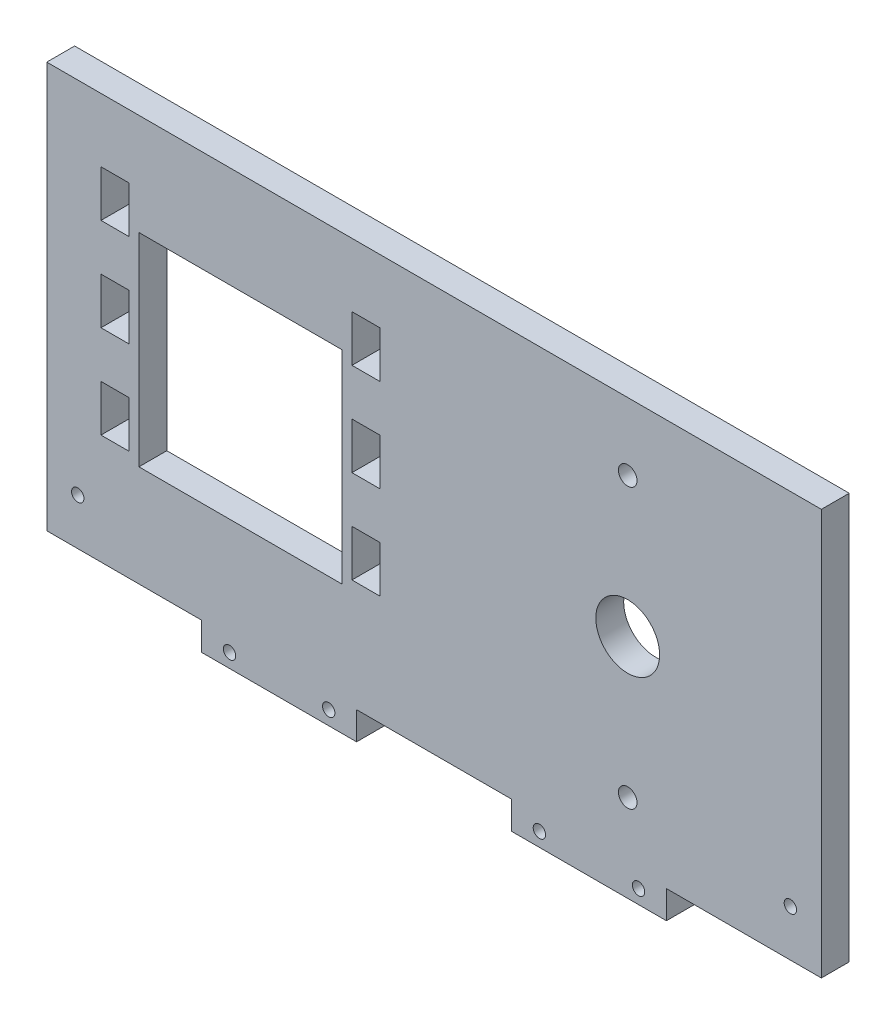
from build123d import *

# Parameters (mm, degrees)
EXTRUDE_1_DEPTH                 = 9
SKETCH_2_R                      = 2
CUT_EXTRUDE_1_DEPTH             = 9
HOLE_WIZARD_4_100_1_D           = 3.2639
HOLE_WIZARD_4_100_1_CSINK_D     = 5.715
HOLE_WIZARD_4_100_1_CSINK_ANGLE = 100
SKETCH_4_R                      = 10.3
CUT_EXTRUDE_2_DEPTH             = 10
SKETCH_5_R                      = 3
CUT_EXTRUDE_4_DEPTH             = 9
SKETCH_4_5_R                    = 10.3
SKETCH_4_5_W                    = 65.5
SKETCH_4_5_H                    = 65.5
CUT_EXTRUDE_5_DEPTH             = 10
SKETCH_6_W                      = 9
SKETCH_6_H                      = 15
CUT_EXTRUDE_6_DEPTH             = 10
SKETCH_7_R                      = 2
CUT_EXTRUDE_9_DEPTH             = 10


with BuildPart() as part:
    # Sketch 1 → Extrude 1 (new body)
    with BuildSketch(Plane.XY):
        Polygon((-49.003050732, 68.952265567), (0.996949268, 68.952265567), (0.996949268, 59.952265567), (50.996949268, 59.952265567), (50.996949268, 68.952265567), (100.996949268, 68.952265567), (100.996949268, 59.952265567), (150.996949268, 59.952265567), (150.996949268, 68.952265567), (200.996949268, 68.952265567), (200.996949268, 199.952265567), (-49.003050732, 199.952265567), align=None)
    extrude(amount=EXTRUDE_1_DEPTH)

    # Sketch 2 → Cut-Extrude 1 (cut)
    with BuildSketch(Plane.XY.offset(9)):
        with Locations((9.996949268, 64.452265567)):
            Circle(SKETCH_2_R)
        with Locations((41.996949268, 64.452265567)):
            Circle(SKETCH_2_R)
        with Locations(Location((141.996949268, 64.452265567, 0), (0, 0, 180))):
            Circle(SKETCH_2_R)
        with Locations(Location((109.996949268, 64.452265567, 0), (0, 0, 180))):
            Circle(SKETCH_2_R)
    extrude(amount=-CUT_EXTRUDE_1_DEPTH, mode=Mode.SUBTRACT)

    # Hole Wizard 4_100_1 (through all)
    with Locations(Plane(origin=(141.996949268, 64.452265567, 0), x_dir=(-1, 0, 0), z_dir=(0, 0, -1))):
        with Locations((0, 0), (32, 0), (132, 0), (100, 0)):
            CounterSinkHole(HOLE_WIZARD_4_100_1_D / 2, HOLE_WIZARD_4_100_1_CSINK_D / 2, counter_sink_angle=HOLE_WIZARD_4_100_1_CSINK_ANGLE)

    # Sketch 4 → Cut-Extrude 2 (cut)
    with BuildSketch(Plane(origin=(0, 0, 0), x_dir=(-1, 0, 0), z_dir=(0, 0, -1))):
        with Locations((-138.496949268, 133.166228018)):
            Circle(SKETCH_4_R)
    extrude(amount=-CUT_EXTRUDE_2_DEPTH, mode=Mode.SUBTRACT)

    # Sketch 5 → Cut-Extrude 4 (cut)
    with BuildSketch(Plane.XY.offset(9)):
        with Locations((138.496949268, 88.166228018)):
            Circle(SKETCH_5_R)
        with Locations((138.496949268, 178.166228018)):
            Circle(SKETCH_5_R)
    extrude(amount=-CUT_EXTRUDE_4_DEPTH, mode=Mode.SUBTRACT)

    # Sketch 4_5 → Cut-Extrude 5 (cut)
    with BuildSketch(Plane(origin=(0, 0, 0), x_dir=(-1, 0, 0), z_dir=(0, 0, -1))):
        with Locations((-138.496949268, 133.166228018)):
            Circle(SKETCH_4_5_R)
        with Locations((-13.496949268, 134.452265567)):
            Rectangle(SKETCH_4_5_W, SKETCH_4_5_H)
    extrude(amount=-CUT_EXTRUDE_5_DEPTH, mode=Mode.SUBTRACT)

    # Sketch 6 → Cut-Extrude 6 (cut)
    with BuildSketch(Plane(origin=(0, 0, 0), x_dir=(-1, 0, 0), z_dir=(0, 0, -1))):
        with Locations((-53.996949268, 171.952265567)):
            Rectangle(SKETCH_6_W, SKETCH_6_H)
        with Locations((-53.996949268, 141.952265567)):
            Rectangle(SKETCH_6_W, SKETCH_6_H)
        with Locations((-53.996949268, 111.952265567)):
            Rectangle(SKETCH_6_W, SKETCH_6_H)
        with Locations((27.003050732, 111.952265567)):
            Rectangle(SKETCH_6_W, SKETCH_6_H)
        with Locations((27.003050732, 141.952265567)):
            Rectangle(SKETCH_6_W, SKETCH_6_H)
        with Locations((27.003050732, 171.952265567)):
            Rectangle(SKETCH_6_W, SKETCH_6_H)
    extrude(amount=-CUT_EXTRUDE_6_DEPTH, mode=Mode.SUBTRACT)

    # Sketch 7 → Cut-Extrude 9 (cut)
    with BuildSketch(Plane.XY.offset(9)):
        with Locations((-39.003050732, 83.952265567)):
            Circle(SKETCH_7_R)
        with Locations((190.996949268, 83.952265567)):
            Circle(SKETCH_7_R)
    extrude(amount=-CUT_EXTRUDE_9_DEPTH, mode=Mode.SUBTRACT)


solid = part.part
